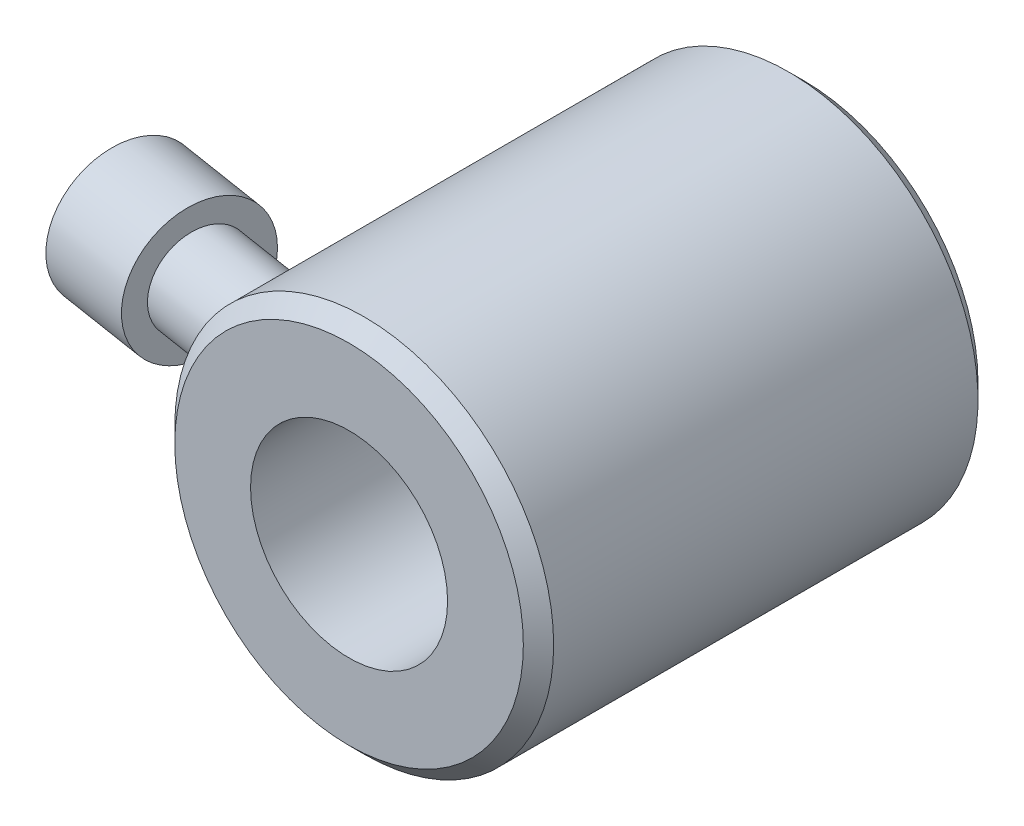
ISO-10303-21;
HEADER;
FILE_DESCRIPTION(('STEP AP214'),'2;1');
FILE_NAME('part.step','',(''),(''),'','','');
FILE_SCHEMA(('AUTOMOTIVE_DESIGN { 1 0 10303 214 1 1 1 1 }'));
ENDSEC;
DATA;
#1=APPLICATION_CONTEXT('core data for automotive mechanical design processes');
#2=APPLICATION_PROTOCOL_DEFINITION('international standard','automotive_design',2000,#1);
#3=PRODUCT_CONTEXT('',#1,'mechanical');
#4=PRODUCT('Part','Part','',(#3));
#5=PRODUCT_RELATED_PRODUCT_CATEGORY('part','',(#4));
#6=PRODUCT_DEFINITION_FORMATION('','',#4);
#7=PRODUCT_DEFINITION_CONTEXT('part definition',#1,'design');
#8=PRODUCT_DEFINITION('design','',#6,#7);
#9=PRODUCT_DEFINITION_SHAPE('','',#8);
#10=(LENGTH_UNIT() NAMED_UNIT(*) SI_UNIT(.MILLI.,.METRE.));
#11=(NAMED_UNIT(*) PLANE_ANGLE_UNIT() SI_UNIT($,.RADIAN.));
#12=(NAMED_UNIT(*) SI_UNIT($,.STERADIAN.) SOLID_ANGLE_UNIT());
#13=UNCERTAINTY_MEASURE_WITH_UNIT(LENGTH_MEASURE(1.E-05),#10,'distance_accuracy_value','');
#14=(GEOMETRIC_REPRESENTATION_CONTEXT(3) GLOBAL_UNCERTAINTY_ASSIGNED_CONTEXT((#13)) GLOBAL_UNIT_ASSIGNED_CONTEXT((#10,
#11,#12)) REPRESENTATION_CONTEXT('',''));
#15=CARTESIAN_POINT('',(0.,0.,0.));
#16=DIRECTION('',(0.,0.,1.));
#17=DIRECTION('',(1.,0.,0.));
#18=AXIS2_PLACEMENT_3D('',#15,#16,#17);
#19=CARTESIAN_POINT('',(0.,0.,64.));
#20=DIRECTION('',(0.,0.,1.));
#21=DIRECTION('',(-1.,0.,0.));
#22=AXIS2_PLACEMENT_3D('',#19,#20,#21);
#23=CYLINDRICAL_SURFACE('',#22,25.);
#24=CARTESIAN_POINT('',(-25.,0.,36.0335852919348));
#25=CARTESIAN_POINT('',(-25.0000025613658,-0.160958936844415,36.0335798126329));
#26=CARTESIAN_POINT('',(-24.9984430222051,-0.321867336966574,36.0403916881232));
#27=CARTESIAN_POINT('',(-24.9922555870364,-0.642524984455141,36.0675508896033));
#28=CARTESIAN_POINT('',(-24.9876272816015,-0.802274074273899,36.0879000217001));
#29=CARTESIAN_POINT('',(-24.9754291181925,-1.11944267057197,36.1419265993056));
#30=CARTESIAN_POINT('',(-24.9678580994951,-1.27686123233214,36.1756093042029));
#31=CARTESIAN_POINT('',(-24.9499856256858,-1.58825269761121,36.2559548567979));
#32=CARTESIAN_POINT('',(-24.9396831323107,-1.74222426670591,36.3026226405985));
#33=CARTESIAN_POINT('',(-24.9166642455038,-2.0452057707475,36.4083146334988));
#34=CARTESIAN_POINT('',(-24.9039544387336,-2.19422796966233,36.4673051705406));
#35=CARTESIAN_POINT('',(-24.8764380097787,-2.48685392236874,36.597178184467));
#36=CARTESIAN_POINT('',(-24.861630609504,-2.63045564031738,36.6680650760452));
#37=CARTESIAN_POINT('',(-24.8303109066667,-2.91129032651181,36.821070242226));
#38=CARTESIAN_POINT('',(-24.813799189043,-3.04852545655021,36.9031846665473));
#39=CARTESIAN_POINT('',(-24.7794825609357,-3.3159388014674,37.0779951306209));
#40=CARTESIAN_POINT('',(-24.7616771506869,-3.44611425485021,37.1706952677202));
#41=CARTESIAN_POINT('',(-24.7055632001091,-3.83474152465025,37.4711993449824));
#42=CARTESIAN_POINT('',(-24.6658104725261,-4.08048334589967,37.6955171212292));
#43=CARTESIAN_POINT('',(-24.5866599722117,-4.53311957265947,38.1804968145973));
#44=CARTESIAN_POINT('',(-24.5472623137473,-4.74000186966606,38.4411700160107));
#45=CARTESIAN_POINT('',(-24.4903550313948,-5.02319518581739,38.8622533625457));
#46=CARTESIAN_POINT('',(-24.4712665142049,-5.11515102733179,39.0121514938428));
#47=CARTESIAN_POINT('',(-24.4348553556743,-5.28635096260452,39.3192202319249));
#48=CARTESIAN_POINT('',(-24.4175321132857,-5.36559938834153,39.4763883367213));
#49=CARTESIAN_POINT('',(-24.3851580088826,-5.51086312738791,39.7970341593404));
#50=CARTESIAN_POINT('',(-24.3701082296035,-5.57687214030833,39.9605148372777));
#51=CARTESIAN_POINT('',(-24.342758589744,-5.69506674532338,40.2925543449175));
#52=CARTESIAN_POINT('',(-24.3304576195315,-5.74725791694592,40.46111109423));
#53=CARTESIAN_POINT('',(-24.3089408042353,-5.83759948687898,40.8030647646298));
#54=CARTESIAN_POINT('',(-24.2997409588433,-5.87567716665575,40.9764819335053));
#55=CARTESIAN_POINT('',(-24.2848352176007,-5.93698374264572,41.3260055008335));
#56=CARTESIAN_POINT('',(-24.2791279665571,-5.96021839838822,41.5021108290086));
#57=CARTESIAN_POINT('',(-24.2714206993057,-5.99152725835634,41.8557408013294));
#58=CARTESIAN_POINT('',(-24.2694205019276,-5.99960220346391,42.0332653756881));
#59=CARTESIAN_POINT('',(-24.2692310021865,-6.00036905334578,42.3883494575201));
#60=CARTESIAN_POINT('',(-24.2710415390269,-5.99306160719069,42.5659089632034));
#61=CARTESIAN_POINT('',(-24.278296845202,-5.96359943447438,42.912281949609));
#62=CARTESIAN_POINT('',(-24.2835875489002,-5.9420739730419,43.0811523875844));
#63=CARTESIAN_POINT('',(-24.2975168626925,-5.88485691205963,43.4163344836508));
#64=CARTESIAN_POINT('',(-24.3061553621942,-5.84916578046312,43.5826462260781));
#65=CARTESIAN_POINT('',(-24.3265392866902,-5.76380159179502,43.9114248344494));
#66=CARTESIAN_POINT('',(-24.338284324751,-5.7141302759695,44.0738921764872));
#67=CARTESIAN_POINT('',(-24.3645412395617,-5.60111528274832,44.3937683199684));
#68=CARTESIAN_POINT('',(-24.379053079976,-5.53777178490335,44.5511771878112));
#69=CARTESIAN_POINT('',(-24.4099464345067,-5.39993964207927,44.8551523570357));
#70=CARTESIAN_POINT('',(-24.4262593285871,-5.32583946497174,45.0019019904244));
#71=CARTESIAN_POINT('',(-24.4606344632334,-5.16566259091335,45.2885634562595));
#72=CARTESIAN_POINT('',(-24.4786972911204,-5.07958186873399,45.4284729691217));
#73=CARTESIAN_POINT('',(-24.5160565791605,-4.89609321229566,45.7004096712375));
#74=CARTESIAN_POINT('',(-24.535352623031,-4.79868909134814,45.8324394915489));
#75=CARTESIAN_POINT('',(-24.5746561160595,-4.59317130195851,46.0878496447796));
#76=CARTESIAN_POINT('',(-24.594663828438,-4.48505364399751,46.2112267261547));
#77=CARTESIAN_POINT('',(-24.6349461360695,-4.25825826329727,46.4491502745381));
#78=CARTESIAN_POINT('',(-24.6552215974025,-4.13952501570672,46.563643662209));
#79=CARTESIAN_POINT('',(-24.6953788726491,-3.8927992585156,46.7823477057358));
#80=CARTESIAN_POINT('',(-24.7152605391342,-3.76480336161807,46.8865545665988));
#81=CARTESIAN_POINT('',(-24.7540750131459,-3.50051425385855,47.0839595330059));
#82=CARTESIAN_POINT('',(-24.7730081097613,-3.36422359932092,47.1771610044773));
#83=CARTESIAN_POINT('',(-24.8094276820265,-3.08419178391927,47.352050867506));
#84=CARTESIAN_POINT('',(-24.8269136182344,-2.9404478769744,47.4337349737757));
#85=CARTESIAN_POINT('',(-24.860188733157,-2.64451979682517,47.586086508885));
#86=CARTESIAN_POINT('',(-24.875951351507,-2.49224690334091,47.6565874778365));
#87=CARTESIAN_POINT('',(-24.9050727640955,-2.18211273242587,47.7847791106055));
#88=CARTESIAN_POINT('',(-24.9184306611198,-2.02424939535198,47.8424649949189));
#89=CARTESIAN_POINT('',(-24.9423653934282,-1.70415734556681,47.9446073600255));
#90=CARTESIAN_POINT('',(-24.9529432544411,-1.5419302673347,47.9890687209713));
#91=CARTESIAN_POINT('',(-24.9710394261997,-1.21414544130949,48.0645205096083));
#92=CARTESIAN_POINT('',(-24.978556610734,-1.04858649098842,48.0955059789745));
#93=CARTESIAN_POINT('',(-24.9903229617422,-0.715237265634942,48.1437960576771));
#94=CARTESIAN_POINT('',(-24.9945697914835,-0.547445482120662,48.161090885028));
#95=CARTESIAN_POINT('',(-24.9996783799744,-0.210940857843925,48.1818661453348));
#96=CARTESIAN_POINT('',(-25.0005388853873,-0.0422276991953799,48.1853414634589));
#97=CARTESIAN_POINT('',(-24.9979651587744,0.463350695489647,48.1749311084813));
#98=CARTESIAN_POINT('',(-24.9893887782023,0.800022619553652,48.1402620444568));
#99=CARTESIAN_POINT('',(-24.9594432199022,1.46143291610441,48.0164783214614));
#100=CARTESIAN_POINT('',(-24.9381101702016,1.78620225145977,47.927517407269));
#101=CARTESIAN_POINT('',(-24.884998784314,2.41591794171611,47.697566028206));
#102=CARTESIAN_POINT('',(-24.8532200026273,2.72086345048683,47.5565733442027));
#103=CARTESIAN_POINT('',(-24.7825540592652,3.30324934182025,47.2255798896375));
#104=CARTESIAN_POINT('',(-24.7436449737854,3.58060070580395,47.035427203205));
#105=CARTESIAN_POINT('',(-24.6630880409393,4.09890011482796,46.6111436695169));
#106=CARTESIAN_POINT('',(-24.6214402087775,4.33984836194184,46.3770130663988));
#107=CARTESIAN_POINT('',(-24.5401763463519,4.77801637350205,45.871346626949));
#108=CARTESIAN_POINT('',(-24.5005566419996,4.97531753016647,45.5998819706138));
#109=CARTESIAN_POINT('',(-24.4278134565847,5.32102159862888,45.0266547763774));
#110=CARTESIAN_POINT('',(-24.3946890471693,5.46943150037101,44.7248965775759));
#111=CARTESIAN_POINT('',(-24.3391720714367,5.71139051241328,44.1043759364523));
#112=CARTESIAN_POINT('',(-24.3166287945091,5.80571457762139,43.785928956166));
#113=CARTESIAN_POINT('',(-24.2840210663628,5.94063945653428,43.1372646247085));
#114=CARTESIAN_POINT('',(-24.2739560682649,5.98124262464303,42.8070477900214));
#115=CARTESIAN_POINT('',(-24.2672495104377,6.00839294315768,42.1456086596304));
#116=CARTESIAN_POINT('',(-24.2705559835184,5.99514936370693,41.8143952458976));
#117=CARTESIAN_POINT('',(-24.2898501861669,5.916481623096,41.1586139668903));
#118=CARTESIAN_POINT('',(-24.3058400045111,5.8510488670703,40.8340472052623));
#119=CARTESIAN_POINT('',(-24.3492218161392,5.66784713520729,40.1899937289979));
#120=CARTESIAN_POINT('',(-24.3769511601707,5.54852209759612,39.8709745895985));
#121=CARTESIAN_POINT('',(-24.4406664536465,5.2607429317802,39.2565809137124));
#122=CARTESIAN_POINT('',(-24.4766546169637,5.09227562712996,38.9612127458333));
#123=CARTESIAN_POINT('',(-24.5346569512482,4.80217106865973,38.535947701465));
#124=CARTESIAN_POINT('',(-24.5551133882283,4.6967226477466,38.3945259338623));
#125=CARTESIAN_POINT('',(-24.5966078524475,4.47433503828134,38.1211401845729));
#126=CARTESIAN_POINT('',(-24.6176456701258,4.35739995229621,37.9891728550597));
#127=CARTESIAN_POINT('',(-24.6597146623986,4.11265073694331,37.7355897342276));
#128=CARTESIAN_POINT('',(-24.6807458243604,3.98482976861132,37.6139805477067));
#129=CARTESIAN_POINT('',(-24.7221705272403,3.71918580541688,37.382213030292));
#130=CARTESIAN_POINT('',(-24.7425643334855,3.58136705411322,37.2720498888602));
#131=CARTESIAN_POINT('',(-24.7820720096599,3.29688819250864,37.0643344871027));
#132=CARTESIAN_POINT('',(-24.8011889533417,3.15025105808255,36.9667513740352));
#133=CARTESIAN_POINT('',(-24.8376149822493,2.84884419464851,36.7848335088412));
#134=CARTESIAN_POINT('',(-24.8549248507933,2.69407803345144,36.7004930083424));
#135=CARTESIAN_POINT('',(-24.8871955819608,2.37755433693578,36.5459435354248));
#136=CARTESIAN_POINT('',(-24.902158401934,2.21580277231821,36.4757227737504));
#137=CARTESIAN_POINT('',(-24.9292710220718,1.88646995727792,36.3501307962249));
#138=CARTESIAN_POINT('',(-24.9414214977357,1.71889011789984,36.2947560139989));
#139=CARTESIAN_POINT('',(-24.9675679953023,1.29761833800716,36.1766496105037));
#140=CARTESIAN_POINT('',(-24.979655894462,1.04116124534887,36.1231194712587));
#141=CARTESIAN_POINT('',(-24.9958692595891,0.523091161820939,36.051594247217));
#142=CARTESIAN_POINT('',(-24.9999958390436,0.261478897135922,36.0335941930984));
#143=CARTESIAN_POINT('',(-25.,0.,36.0335852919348));
#144=B_SPLINE_CURVE_WITH_KNOTS('',3,(#24,#25,#26,#27,#28,#29,#30,#31,#32,#33,#34,#35,#36,#37,
#38,#39,#40,#41,#42,#43,#44,#45,#46,#47,#48,#49,#50,#51,#52,#53,#54,#55,#56,#57,#58,#59,#60,#61,
#62,#63,#64,#65,#66,#67,#68,#69,#70,#71,#72,#73,#74,#75,#76,#77,#78,#79,#80,#81,#82,#83,#84,#85,
#86,#87,#88,#89,#90,#91,#92,#93,#94,#95,#96,#97,#98,#99,#100,#101,#102,#103,#104,#105,#106,#107,
#108,#109,#110,#111,#112,#113,#114,#115,#116,#117,#118,#119,#120,#121,#122,#123,#124,#125,#126,
#127,#128,#129,#130,#131,#132,#133,#134,#135,#136,#137,#138,#139,#140,#141,#142,#143),
.UNSPECIFIED.,.T.,.F.,(4,2,2,2,2,2,2,2,2,2,2,2,2,2,2,2,2,2,2,2,2,2,2,2,2,2,2,2,2,2,2,2,2,2,2,2,
2,2,2,2,2,2,2,2,2,2,2,2,2,2,2,2,2,2,2,2,2,2,2,4),(0.,0.482638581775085,0.965341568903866,
1.44823514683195,1.93131254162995,2.41308679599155,2.89504023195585,3.3768288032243,
3.85880449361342,4.85945376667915,5.86041432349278,6.3905576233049,6.92051981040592,
7.45073360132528,7.98073296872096,8.51342635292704,9.04591291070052,9.57837344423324,
10.1108115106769,10.6211355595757,11.1314427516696,11.6416864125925,12.15192337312,
12.6469521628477,13.1421476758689,13.6371769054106,14.1323911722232,14.6303669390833,
15.1285257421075,15.6265317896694,16.1247226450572,16.6297462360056,17.1349578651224,
17.6399828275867,18.1451934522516,18.6507647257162,19.1565231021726,20.1669386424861,
21.1745060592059,22.1821164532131,23.1928786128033,24.2036351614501,25.2124906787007,
26.2212018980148,27.2150736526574,28.2089018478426,29.1988713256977,30.1890038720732,
31.2097591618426,32.2307883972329,32.7630377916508,33.2950977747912,33.8274945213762,
34.359666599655,34.8905076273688,35.4211175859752,35.9512826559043,36.4813202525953,
37.26547962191,38.0495293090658),.UNSPECIFIED.);
#145=CARTESIAN_POINT('',(-25.,0.,36.0335852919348));
#146=VERTEX_POINT('',#145);
#147=EDGE_CURVE('E9',#146,#146,#144,.T.);
#148=ORIENTED_EDGE('',*,*,#147,.F.);
#149=EDGE_LOOP('',(#148));
#150=FACE_BOUND('',#149,.T.);
#151=CARTESIAN_POINT('',(0.,0.,58.));
#152=DIRECTION('',(0.,0.,-1.));
#153=DIRECTION('',(1.,0.,0.));
#154=AXIS2_PLACEMENT_3D('',#151,#152,#153);
#155=CIRCLE('',#154,25.);
#156=CARTESIAN_POINT('',(25.,0.,58.));
#157=VERTEX_POINT('',#156);
#158=EDGE_CURVE('E199',#157,#157,#155,.T.);
#159=ORIENTED_EDGE('',*,*,#158,.T.);
#160=EDGE_LOOP('',(#159));
#161=FACE_BOUND('',#160,.T.);
#162=CARTESIAN_POINT('',(0.,0.,2.00000000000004));
#163=DIRECTION('',(0.,0.,1.));
#164=DIRECTION('',(-1.,0.,0.));
#165=AXIS2_PLACEMENT_3D('',#162,#163,#164);
#166=CIRCLE('',#165,25.);
#167=CARTESIAN_POINT('',(-25.,0.,2.00000000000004));
#168=VERTEX_POINT('',#167);
#169=EDGE_CURVE('E203',#168,#168,#166,.T.);
#170=ORIENTED_EDGE('',*,*,#169,.T.);
#171=EDGE_LOOP('',(#170));
#172=FACE_BOUND('',#171,.T.);
#173=CARTESIAN_POINT('',(-1.25,-24.9687304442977,17.));
#174=CARTESIAN_POINT('',(-1.24999690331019,-24.9687308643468,17.0701659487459));
#175=CARTESIAN_POINT('',(-1.24407224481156,-24.96902938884,17.1403816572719));
#176=CARTESIAN_POINT('',(-1.2205216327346,-24.9701914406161,17.2788760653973));
#177=CARTESIAN_POINT('',(-1.20288189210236,-24.9710556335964,17.3471523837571));
#178=CARTESIAN_POINT('',(-1.15640743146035,-24.9732508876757,17.4797417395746));
#179=CARTESIAN_POINT('',(-1.12757841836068,-24.9745817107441,17.5440567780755));
#180=CARTESIAN_POINT('',(-1.05955252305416,-24.9775599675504,17.6669173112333));
#181=CARTESIAN_POINT('',(-1.02035808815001,-24.9792073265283,17.7254641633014));
#182=CARTESIAN_POINT('',(-0.932669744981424,-24.9826349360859,17.8352030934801));
#183=CARTESIAN_POINT('',(-0.884167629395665,-24.9844153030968,17.8863886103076));
#184=CARTESIAN_POINT('',(-0.779257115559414,-24.9879072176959,17.9798959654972));
#185=CARTESIAN_POINT('',(-0.722848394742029,-24.9896187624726,18.0222174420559));
#186=CARTESIAN_POINT('',(-0.603691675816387,-24.9927810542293,18.0968133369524));
#187=CARTESIAN_POINT('',(-0.540940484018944,-24.9942316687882,18.1290826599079));
#188=CARTESIAN_POINT('',(-0.410902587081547,-24.9967074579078,18.1826255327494));
#189=CARTESIAN_POINT('',(-0.343615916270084,-24.9977326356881,18.2038991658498));
#190=CARTESIAN_POINT('',(-0.206477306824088,-24.9992412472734,18.2348294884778));
#191=CARTESIAN_POINT('',(-0.136627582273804,-24.9997251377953,18.2444959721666));
#192=CARTESIAN_POINT('',(0.00370464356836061,-25.0000981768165,18.2519678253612));
#193=CARTESIAN_POINT('',(0.0741871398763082,-24.9999873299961,18.2497732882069));
#194=CARTESIAN_POINT('',(0.213717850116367,-24.9991837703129,18.2335935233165));
#195=CARTESIAN_POINT('',(0.282767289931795,-24.9984915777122,18.2196188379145));
#196=CARTESIAN_POINT('',(0.417538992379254,-24.9966038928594,18.180291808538));
#197=CARTESIAN_POINT('',(0.483261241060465,-24.9954083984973,18.1549394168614));
#198=CARTESIAN_POINT('',(0.609546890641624,-24.9926478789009,18.09356461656));
#199=CARTESIAN_POINT('',(0.670107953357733,-24.9910826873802,18.0575374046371));
#200=CARTESIAN_POINT('',(0.784326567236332,-24.9877590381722,17.9758391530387));
#201=CARTESIAN_POINT('',(0.837984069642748,-24.9860005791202,17.9301680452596));
#202=CARTESIAN_POINT('',(0.936933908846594,-24.9824861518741,17.8304188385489));
#203=CARTESIAN_POINT('',(0.982217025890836,-24.9807301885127,17.7763315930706));
#204=CARTESIAN_POINT('',(1.06306164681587,-24.9774206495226,17.6613175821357));
#205=CARTESIAN_POINT('',(1.09862314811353,-24.9758670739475,17.6003908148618));
#206=CARTESIAN_POINT('',(1.15901427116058,-24.9731376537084,17.4734216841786));
#207=CARTESIAN_POINT('',(1.18384354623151,-24.9719618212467,17.4073791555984));
#208=CARTESIAN_POINT('',(1.2220592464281,-24.9701209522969,17.2720557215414));
#209=CARTESIAN_POINT('',(1.2354457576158,-24.9694559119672,17.2027748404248));
#210=CARTESIAN_POINT('',(1.25038453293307,-24.9687123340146,17.0630216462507));
#211=CARTESIAN_POINT('',(1.25194959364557,-24.9686331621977,16.992550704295));
#212=CARTESIAN_POINT('',(1.24323443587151,-24.9690685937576,16.8523472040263));
#213=CARTESIAN_POINT('',(1.23295425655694,-24.9695831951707,16.7826146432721));
#214=CARTESIAN_POINT('',(1.20085104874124,-24.9711475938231,16.6459033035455));
#215=CARTESIAN_POINT('',(1.17903387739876,-24.9721971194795,16.5789231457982));
#216=CARTESIAN_POINT('',(1.1244819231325,-24.9747128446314,16.4495754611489));
#217=CARTESIAN_POINT('',(1.09174707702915,-24.9761790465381,16.3872079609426));
#218=CARTESIAN_POINT('',(1.0162561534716,-24.9793644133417,16.2687971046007));
#219=CARTESIAN_POINT('',(0.973491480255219,-24.9810837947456,16.2127592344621));
#220=CARTESIAN_POINT('',(0.87916739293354,-24.9845809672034,16.1086535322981));
#221=CARTESIAN_POINT('',(0.827607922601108,-24.9863587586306,16.0605857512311));
#222=CARTESIAN_POINT('',(0.717102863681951,-24.9897742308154,15.973741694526));
#223=CARTESIAN_POINT('',(0.658150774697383,-24.9914117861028,15.9349736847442));
#224=CARTESIAN_POINT('',(0.534566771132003,-24.9943604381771,15.8678861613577));
#225=CARTESIAN_POINT('',(0.469934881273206,-24.995671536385,15.8395666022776));
#226=CARTESIAN_POINT('',(0.336856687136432,-24.9978189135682,15.7941943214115));
#227=CARTESIAN_POINT('',(0.268412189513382,-24.9986554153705,15.7771363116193));
#228=CARTESIAN_POINT('',(0.129626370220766,-24.999760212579,15.7547540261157));
#229=CARTESIAN_POINT('',(0.0592850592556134,-25.0000285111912,15.7494296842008));
#230=CARTESIAN_POINT('',(-0.081215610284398,-24.999966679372,15.7506665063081));
#231=CARTESIAN_POINT('',(-0.151375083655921,-24.9996372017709,15.7572147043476));
#232=CARTESIAN_POINT('',(-0.289597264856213,-24.9984181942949,15.7819839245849));
#233=CARTESIAN_POINT('',(-0.357659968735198,-24.9975286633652,15.80020496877));
#234=CARTESIAN_POINT('',(-0.489759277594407,-24.9952896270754,15.847800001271));
#235=CARTESIAN_POINT('',(-0.553795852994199,-24.9939401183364,15.8771740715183));
#236=CARTESIAN_POINT('',(-0.676029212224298,-24.9909328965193,15.946239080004));
#237=CARTESIAN_POINT('',(-0.734226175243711,-24.9892751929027,15.9859297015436));
#238=CARTESIAN_POINT('',(-0.843193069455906,-24.9858360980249,16.0745475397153));
#239=CARTESIAN_POINT('',(-0.893955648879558,-24.9840545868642,16.1234837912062));
#240=CARTESIAN_POINT('',(-0.98656087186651,-24.980569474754,16.2291978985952));
#241=CARTESIAN_POINT('',(-1.02840131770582,-24.9788658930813,16.2859776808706));
#242=CARTESIAN_POINT('',(-1.10199421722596,-24.9757276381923,16.405811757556));
#243=CARTESIAN_POINT('',(-1.13373694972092,-24.9742932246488,16.4688720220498));
#244=CARTESIAN_POINT('',(-1.18614637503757,-24.971859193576,16.5993869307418));
#245=CARTESIAN_POINT('',(-1.20682615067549,-24.970859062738,16.6668362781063));
#246=CARTESIAN_POINT('',(-1.23109826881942,-24.9696711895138,16.7789205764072));
#247=CARTESIAN_POINT('',(-1.23817736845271,-24.969319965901,16.8228295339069));
#248=CARTESIAN_POINT('',(-1.24762921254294,-24.9688494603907,16.9111523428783));
#249=CARTESIAN_POINT('',(-1.25000196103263,-24.9687301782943,16.9555661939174));
#250=CARTESIAN_POINT('',(-1.25,-24.9687304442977,17.));
#251=B_SPLINE_CURVE_WITH_KNOTS('',3,(#173,#174,#175,#176,#177,#178,#179,#180,#181,#182,#183,
#184,#185,#186,#187,#188,#189,#190,#191,#192,#193,#194,#195,#196,#197,#198,#199,#200,#201,#202,
#203,#204,#205,#206,#207,#208,#209,#210,#211,#212,#213,#214,#215,#216,#217,#218,#219,#220,#221,
#222,#223,#224,#225,#226,#227,#228,#229,#230,#231,#232,#233,#234,#235,#236,#237,#238,#239,#240,
#241,#242,#243,#244,#245,#246,#247,#248,#249,#250),.UNSPECIFIED.,.T.,.F.,(4,2,2,2,2,2,2,2,2,2,2,
2,2,2,2,2,2,2,2,2,2,2,2,2,2,2,2,2,2,2,2,2,2,2,2,2,2,2,4),(0.,0.210335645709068,
0.420919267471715,0.631395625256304,0.841822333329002,1.0524354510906,1.26305716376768,
1.47378546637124,1.68451217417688,1.89506094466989,2.10560805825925,2.31596694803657,
2.52632671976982,2.73678129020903,2.94723734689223,3.1579237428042,3.36861019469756,
3.57930345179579,3.78999512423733,4.00045869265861,4.2109215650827,4.42127769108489,
4.63163503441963,4.84217332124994,5.05271295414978,5.26343903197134,5.47416419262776,
5.68479033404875,5.89541528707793,6.10581035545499,6.31620582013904,6.52660283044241,
6.73699338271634,6.94759060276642,7.15823963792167,7.36909085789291,7.57969217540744,
7.71289099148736,7.84608969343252),.UNSPECIFIED.);
#252=CARTESIAN_POINT('',(-1.25,-24.9687304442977,17.));
#253=VERTEX_POINT('',#252);
#254=EDGE_CURVE('E137',#253,#253,#251,.T.);
#255=ORIENTED_EDGE('',*,*,#254,.T.);
#256=EDGE_LOOP('',(#255));
#257=FACE_BOUND('',#256,.T.);
#258=ADVANCED_FACE('F14',(#150,#161,#172,#257),#23,.T.);
#259=CARTESIAN_POINT('',(0.,0.,64.));
#260=DIRECTION('',(0.,0.,1.));
#261=DIRECTION('',(-1.,0.,0.));
#262=AXIS2_PLACEMENT_3D('',#259,#260,#261);
#263=CYLINDRICAL_SURFACE('',#262,13.);
#264=CARTESIAN_POINT('',(0.,0.,60.));
#265=DIRECTION('',(0.,0.,1.));
#266=DIRECTION('',(-1.,0.,0.));
#267=AXIS2_PLACEMENT_3D('',#264,#265,#266);
#268=CIRCLE('',#267,13.);
#269=CARTESIAN_POINT('',(-13.,0.,60.));
#270=VERTEX_POINT('',#269);
#271=EDGE_CURVE('E144',#270,#270,#268,.T.);
#272=ORIENTED_EDGE('',*,*,#271,.T.);
#273=EDGE_LOOP('',(#272));
#274=FACE_BOUND('',#273,.T.);
#275=CARTESIAN_POINT('',(0.,0.,8.));
#276=DIRECTION('',(0.,0.,1.));
#277=DIRECTION('',(-1.,0.,0.));
#278=AXIS2_PLACEMENT_3D('',#275,#276,#277);
#279=CIRCLE('',#278,13.);
#280=CARTESIAN_POINT('',(-13.,0.,8.));
#281=VERTEX_POINT('',#280);
#282=EDGE_CURVE('E372',#281,#281,#279,.T.);
#283=ORIENTED_EDGE('',*,*,#282,.F.);
#284=EDGE_LOOP('',(#283));
#285=FACE_BOUND('',#284,.T.);
#286=CARTESIAN_POINT('',(-1.25,-12.9397642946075,17.));
#287=CARTESIAN_POINT('',(-1.24999695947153,-12.9397650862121,17.0700387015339));
#288=CARTESIAN_POINT('',(-1.2440936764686,-12.9403390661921,17.1401240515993));
#289=CARTESIAN_POINT('',(-1.22063294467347,-12.942572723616,17.2783525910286));
#290=CARTESIAN_POINT('',(-1.20306256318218,-12.9442336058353,17.3464935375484));
#291=CARTESIAN_POINT('',(-1.15678313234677,-12.9484512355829,17.478811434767));
#292=CARTESIAN_POINT('',(-1.12808072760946,-12.9510074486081,17.5429907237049));
#293=CARTESIAN_POINT('',(-1.06036454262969,-12.9567270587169,17.665606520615));
#294=CARTESIAN_POINT('',(-1.02135284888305,-12.9598903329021,17.724044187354));
#295=CARTESIAN_POINT('',(-0.933983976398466,-12.9664795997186,17.8337292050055));
#296=CARTESIAN_POINT('',(-0.885599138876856,-12.9699063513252,17.8849544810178));
#297=CARTESIAN_POINT('',(-0.780916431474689,-12.9766295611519,17.9785706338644));
#298=CARTESIAN_POINT('',(-0.724618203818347,-12.9799260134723,18.0209611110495));
#299=CARTESIAN_POINT('',(-0.605572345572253,-12.9860246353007,18.0957800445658));
#300=CARTESIAN_POINT('',(-0.54281244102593,-12.9888258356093,18.1281890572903));
#301=CARTESIAN_POINT('',(-0.412710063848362,-12.9936100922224,18.1820007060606));
#302=CARTESIAN_POINT('',(-0.345367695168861,-12.9955931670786,18.2034035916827));
#303=CARTESIAN_POINT('',(-0.208234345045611,-12.9985124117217,18.2345309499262));
#304=CARTESIAN_POINT('',(-0.138451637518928,-12.9994518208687,18.2442915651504));
#305=CARTESIAN_POINT('',(0.00176737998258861,-13.0001888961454,18.2519691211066));
#306=CARTESIAN_POINT('',(0.0722036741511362,-12.9999865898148,18.2498863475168));
#307=CARTESIAN_POINT('',(0.211485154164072,-12.9984656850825,18.2339656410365));
#308=CARTESIAN_POINT('',(0.2803348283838,-12.9971507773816,18.2201665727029));
#309=CARTESIAN_POINT('',(0.414736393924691,-12.9935567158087,18.1812654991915));
#310=CARTESIAN_POINT('',(0.48028824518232,-12.9912775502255,18.1561633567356));
#311=CARTESIAN_POINT('',(0.606356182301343,-12.9860049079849,18.0953259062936));
#312=CARTESIAN_POINT('',(0.666863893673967,-12.9830102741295,18.0595733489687));
#313=CARTESIAN_POINT('',(0.781034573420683,-12.9766428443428,17.9784624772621));
#314=CARTESIAN_POINT('',(0.834697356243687,-12.9732700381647,17.9331039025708));
#315=CARTESIAN_POINT('',(0.933882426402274,-12.966508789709,17.8338498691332));
#316=CARTESIAN_POINT('',(0.97937089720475,-12.9631203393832,17.7799206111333));
#317=CARTESIAN_POINT('',(1.06065442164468,-12.956723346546,17.6651733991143));
#318=CARTESIAN_POINT('',(1.09644946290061,-12.9537148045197,17.6043554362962));
#319=CARTESIAN_POINT('',(1.15732959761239,-12.9484179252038,17.4775317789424));
#320=CARTESIAN_POINT('',(1.18241268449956,-12.9461297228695,17.411525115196));
#321=CARTESIAN_POINT('',(1.22113055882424,-12.9425353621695,17.2762102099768));
#322=CARTESIAN_POINT('',(1.23476566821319,-12.9412291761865,17.2069020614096));
#323=CARTESIAN_POINT('',(1.25015720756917,-12.9397514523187,17.0672482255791));
#324=CARTESIAN_POINT('',(1.25196090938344,-12.9395753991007,16.9969077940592));
#325=CARTESIAN_POINT('',(1.24376250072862,-12.9403659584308,16.8569256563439));
#326=CARTESIAN_POINT('',(1.23376053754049,-12.9413325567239,16.7872839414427));
#327=CARTESIAN_POINT('',(1.20227423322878,-12.9442953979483,16.650813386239));
#328=CARTESIAN_POINT('',(1.18081217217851,-12.9462896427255,16.5839793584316));
#329=CARTESIAN_POINT('',(1.12703762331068,-12.9510814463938,16.4548602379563));
#330=CARTESIAN_POINT('',(1.09472490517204,-12.9538790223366,16.3925752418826));
#331=CARTESIAN_POINT('',(1.0200475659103,-12.9599732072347,16.2741065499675));
#332=CARTESIAN_POINT('',(0.977651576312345,-12.9632713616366,16.2179427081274));
#333=CARTESIAN_POINT('',(0.884056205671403,-12.9699899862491,16.1135117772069));
#334=CARTESIAN_POINT('',(0.832856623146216,-12.9734104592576,16.0652448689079));
#335=CARTESIAN_POINT('',(0.722902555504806,-12.9800019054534,15.9778153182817));
#336=CARTESIAN_POINT('',(0.664123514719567,-12.9831720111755,15.93868348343));
#337=CARTESIAN_POINT('',(0.540800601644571,-12.9888929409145,15.8708467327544));
#338=CARTESIAN_POINT('',(0.476256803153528,-12.9914437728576,15.8421416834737));
#339=CARTESIAN_POINT('',(0.343344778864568,-12.9956348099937,15.7960257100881));
#340=CARTESIAN_POINT('',(0.274983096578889,-12.9972765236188,15.7785960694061));
#341=CARTESIAN_POINT('',(0.136286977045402,-12.9994705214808,15.7554645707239));
#342=CARTESIAN_POINT('',(0.0659525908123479,-13.0000228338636,15.7497624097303));
#343=CARTESIAN_POINT('',(-0.0743895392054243,-12.999975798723,15.7502518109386));
#344=CARTESIAN_POINT('',(-0.144397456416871,-12.9993810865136,15.7563955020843));
#345=CARTESIAN_POINT('',(-0.282381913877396,-12.9971159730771,15.7803019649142));
#346=CARTESIAN_POINT('',(-0.350358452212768,-12.9954455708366,15.7980647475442));
#347=CARTESIAN_POINT('',(-0.482351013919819,-12.9912162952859,15.8446921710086));
#348=CARTESIAN_POINT('',(-0.546367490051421,-12.9886575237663,15.8735555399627));
#349=CARTESIAN_POINT('',(-0.668654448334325,-12.9829369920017,15.94155963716));
#350=CARTESIAN_POINT('',(-0.726924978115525,-12.9797752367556,15.9807002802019));
#351=CARTESIAN_POINT('',(-0.836311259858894,-12.9731878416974,16.0683275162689));
#352=CARTESIAN_POINT('',(-0.887398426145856,-12.9697612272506,16.1168497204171));
#353=CARTESIAN_POINT('',(-0.980727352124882,-12.9630385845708,16.2217935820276));
#354=CARTESIAN_POINT('',(-1.02296698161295,-12.9597425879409,16.2782171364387));
#355=CARTESIAN_POINT('',(-1.09747961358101,-12.9536459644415,16.3975071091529));
#356=CARTESIAN_POINT('',(-1.12972870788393,-12.9508465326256,16.4603885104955));
#357=CARTESIAN_POINT('',(-1.18316795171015,-12.946074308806,16.5906599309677));
#358=CARTESIAN_POINT('',(-1.20437063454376,-12.9441005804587,16.6580447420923));
#359=CARTESIAN_POINT('',(-1.22979995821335,-12.941703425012,16.7715126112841));
#360=CARTESIAN_POINT('',(-1.23736469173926,-12.9409796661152,16.8168691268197));
#361=CARTESIAN_POINT('',(-1.24746570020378,-12.9400098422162,16.9081437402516));
#362=CARTESIAN_POINT('',(-1.25000199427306,-12.9397637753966,16.9540618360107));
#363=CARTESIAN_POINT('',(-1.25,-12.9397642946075,17.));
#364=B_SPLINE_CURVE_WITH_KNOTS('',3,(#286,#287,#288,#289,#290,#291,#292,#293,#294,#295,#296,
#297,#298,#299,#300,#301,#302,#303,#304,#305,#306,#307,#308,#309,#310,#311,#312,#313,#314,#315,
#316,#317,#318,#319,#320,#321,#322,#323,#324,#325,#326,#327,#328,#329,#330,#331,#332,#333,#334,
#335,#336,#337,#338,#339,#340,#341,#342,#343,#344,#345,#346,#347,#348,#349,#350,#351,#352,#353,
#354,#355,#356,#357,#358,#359,#360,#361,#362,#363),.UNSPECIFIED.,.T.,.F.,(4,2,2,2,2,2,2,2,2,2,2,
2,2,2,2,2,2,2,2,2,2,2,2,2,2,2,2,2,2,2,2,2,2,2,2,2,2,2,4),(0.,0.209948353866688,
0.420129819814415,0.630186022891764,0.840199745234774,1.05084289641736,1.26149557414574,
1.47255603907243,1.68361171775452,1.89401046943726,2.10440414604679,2.31410263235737,
2.52380366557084,2.73384619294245,2.94389441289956,3.15479252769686,3.36569091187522,
3.5766287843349,3.78756072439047,3.99764937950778,4.20773541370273,4.41741448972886,
4.62709801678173,4.83744259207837,5.04779198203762,5.2588408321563,5.46988698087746,
5.68058189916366,5.8912713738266,6.10111120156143,6.31095122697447,6.52076721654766,
6.73058146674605,6.94120835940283,7.15188590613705,7.36306379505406,7.57400155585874,
7.71170654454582,7.84941100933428),.UNSPECIFIED.);
#365=CARTESIAN_POINT('',(-1.25,-12.9397642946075,17.));
#366=VERTEX_POINT('',#365);
#367=EDGE_CURVE('E136',#366,#366,#364,.T.);
#368=ORIENTED_EDGE('',*,*,#367,.F.);
#369=EDGE_LOOP('',(#368));
#370=FACE_BOUND('',#369,.T.);
#371=ADVANCED_FACE('F168',(#274,#285,#370),#263,.F.);
#372=CARTESIAN_POINT('',(0.,-6.5,0.));
#373=DIRECTION('',(0.,0.,1.));
#374=DIRECTION('',(-1.,0.,0.));
#375=AXIS2_PLACEMENT_3D('',#372,#373,#374);
#376=PLANE('',#375);
#377=CARTESIAN_POINT('',(0.,0.,0.));
#378=DIRECTION('',(0.,0.,1.));
#379=DIRECTION('',(-1.,0.,0.));
#380=AXIS2_PLACEMENT_3D('',#377,#378,#379);
#381=CIRCLE('',#380,23.);
#382=CARTESIAN_POINT('',(-23.,0.,0.));
#383=VERTEX_POINT('',#382);
#384=EDGE_CURVE('E26',#383,#383,#381,.F.);
#385=ORIENTED_EDGE('',*,*,#384,.T.);
#386=EDGE_LOOP('',(#385));
#387=FACE_BOUND('',#386,.T.);
#388=CARTESIAN_POINT('',(0.,0.,0.));
#389=DIRECTION('',(0.,0.,1.));
#390=DIRECTION('',(-1.,0.,0.));
#391=AXIS2_PLACEMENT_3D('',#388,#389,#390);
#392=CIRCLE('',#391,6.5);
#393=CARTESIAN_POINT('',(-6.5,0.,0.));
#394=VERTEX_POINT('',#393);
#395=EDGE_CURVE('E164',#394,#394,#392,.T.);
#396=ORIENTED_EDGE('',*,*,#395,.T.);
#397=EDGE_LOOP('',(#396));
#398=FACE_BOUND('',#397,.T.);
#399=ADVANCED_FACE('F172',(#387,#398),#376,.F.);
#400=CARTESIAN_POINT('',(0.,0.,64.));
#401=DIRECTION('',(0.,0.,1.));
#402=DIRECTION('',(-1.,0.,0.));
#403=AXIS2_PLACEMENT_3D('',#400,#401,#402);
#404=CYLINDRICAL_SURFACE('',#403,6.5);
#405=ORIENTED_EDGE('',*,*,#395,.F.);
#406=EDGE_LOOP('',(#405));
#407=FACE_BOUND('',#406,.T.);
#408=CARTESIAN_POINT('',(0.,0.,8.));
#409=DIRECTION('',(0.,0.,1.));
#410=DIRECTION('',(-1.,0.,0.));
#411=AXIS2_PLACEMENT_3D('',#408,#409,#410);
#412=CIRCLE('',#411,6.5);
#413=CARTESIAN_POINT('',(-6.5,0.,8.));
#414=VERTEX_POINT('',#413);
#415=EDGE_CURVE('E374',#414,#414,#412,.T.);
#416=ORIENTED_EDGE('',*,*,#415,.T.);
#417=EDGE_LOOP('',(#416));
#418=FACE_BOUND('',#417,.T.);
#419=ADVANCED_FACE('F177',(#407,#418),#404,.F.);
#420=CARTESIAN_POINT('',(0.,-13.,8.));
#421=DIRECTION('',(0.,0.,-1.));
#422=DIRECTION('',(1.,0.,0.));
#423=AXIS2_PLACEMENT_3D('',#420,#421,#422);
#424=PLANE('',#423);
#425=ORIENTED_EDGE('',*,*,#415,.F.);
#426=EDGE_LOOP('',(#425));
#427=FACE_BOUND('',#426,.T.);
#428=ORIENTED_EDGE('',*,*,#282,.T.);
#429=EDGE_LOOP('',(#428));
#430=FACE_BOUND('',#429,.T.);
#431=ADVANCED_FACE('F174',(#427,#430),#424,.F.);
#432=CARTESIAN_POINT('',(0.,-25.,60.));
#433=DIRECTION('',(0.,0.,-1.));
#434=DIRECTION('',(1.,0.,0.));
#435=AXIS2_PLACEMENT_3D('',#432,#433,#434);
#436=PLANE('',#435);
#437=CARTESIAN_POINT('',(0.,0.,60.));
#438=DIRECTION('',(0.,0.,-1.));
#439=DIRECTION('',(1.,0.,0.));
#440=AXIS2_PLACEMENT_3D('',#437,#438,#439);
#441=CIRCLE('',#440,23.);
#442=CARTESIAN_POINT('',(23.,0.,60.));
#443=VERTEX_POINT('',#442);
#444=EDGE_CURVE('E166',#443,#443,#441,.F.);
#445=ORIENTED_EDGE('',*,*,#444,.T.);
#446=EDGE_LOOP('',(#445));
#447=FACE_BOUND('',#446,.T.);
#448=ORIENTED_EDGE('',*,*,#271,.F.);
#449=EDGE_LOOP('',(#448));
#450=FACE_BOUND('',#449,.T.);
#451=ADVANCED_FACE('F152',(#447,#450),#436,.F.);
#452=CARTESIAN_POINT('',(0.,17.,17.));
#453=DIRECTION('',(0.,1.,0.));
#454=DIRECTION('',(-1.,0.,0.));
#455=AXIS2_PLACEMENT_3D('',#452,#453,#454);
#456=CYLINDRICAL_SURFACE('',#455,1.25);
#457=ORIENTED_EDGE('',*,*,#254,.F.);
#458=EDGE_LOOP('',(#457));
#459=FACE_BOUND('',#458,.T.);
#460=ORIENTED_EDGE('',*,*,#367,.T.);
#461=EDGE_LOOP('',(#460));
#462=FACE_BOUND('',#461,.T.);
#463=ADVANCED_FACE('F146',(#459,#462),#456,.F.);
#464=CARTESIAN_POINT('',(0.,0.,60.));
#465=DIRECTION('',(0.,0.,-1.));
#466=DIRECTION('',(1.,0.,0.));
#467=AXIS2_PLACEMENT_3D('',#464,#465,#466);
#468=CONICAL_SURFACE('',#467,23.,0.785398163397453);
#469=ORIENTED_EDGE('',*,*,#158,.F.);
#470=EDGE_LOOP('',(#469));
#471=FACE_BOUND('',#470,.T.);
#472=ORIENTED_EDGE('',*,*,#444,.F.);
#473=EDGE_LOOP('',(#472));
#474=FACE_BOUND('',#473,.T.);
#475=ADVANCED_FACE('F151',(#471,#474),#468,.T.);
#476=CARTESIAN_POINT('',(0.,0.,2.00000000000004));
#477=DIRECTION('',(0.,0.,1.));
#478=DIRECTION('',(-1.,0.,0.));
#479=AXIS2_PLACEMENT_3D('',#476,#477,#478);
#480=CONICAL_SURFACE('',#479,25.,0.785398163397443);
#481=ORIENTED_EDGE('',*,*,#384,.F.);
#482=EDGE_LOOP('',(#481));
#483=FACE_BOUND('',#482,.T.);
#484=ORIENTED_EDGE('',*,*,#169,.F.);
#485=EDGE_LOOP('',(#484));
#486=FACE_BOUND('',#485,.T.);
#487=ADVANCED_FACE('F213',(#483,#486),#480,.T.);
#488=CARTESIAN_POINT('',(-53.2715634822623,0.,46.7427864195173));
#489=DIRECTION('',(0.987688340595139,0.,0.156434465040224));
#490=DIRECTION('',(-0.156434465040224,0.,0.987688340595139));
#491=AXIS2_PLACEMENT_3D('',#488,#489,#490);
#492=PLANE('',#491);
#493=DIRECTION('',(-0.135476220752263,0.5,0.855363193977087));
#494=VECTOR('',#493,1.);
#495=CARTESIAN_POINT('',(-51.8636532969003,-5.77350269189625,37.8535913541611));
#496=LINE('',#495,#494);
#497=CARTESIAN_POINT('',(-51.8636532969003,-5.77350269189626,37.8535913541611));
#498=VERTEX_POINT('',#497);
#499=CARTESIAN_POINT('',(-52.6458256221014,-2.88675134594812,42.7920330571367));
#500=VERTEX_POINT('',#499);
#501=EDGE_CURVE('E87',#498,#500,#496,.T.);
#502=ORIENTED_EDGE('',*,*,#501,.F.);
#503=DIRECTION('',(-0.135476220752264,-0.5,0.855363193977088));
#504=VECTOR('',#503,1.);
#505=CARTESIAN_POINT('',(-51.0814809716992,-2.88675134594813,32.9151496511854));
#506=LINE('',#505,#504);
#507=CARTESIAN_POINT('',(-51.0814809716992,-2.88675134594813,32.9151496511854));
#508=VERTEX_POINT('',#507);
#509=EDGE_CURVE('E33',#508,#498,#506,.T.);
#510=ORIENTED_EDGE('',*,*,#509,.F.);
#511=DIRECTION('',(0.,-1.,0.));
#512=VECTOR('',#511,1.);
#513=CARTESIAN_POINT('',(-51.0814809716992,2.88675134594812,32.9151496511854));
#514=LINE('',#513,#512);
#515=CARTESIAN_POINT('',(-51.0814809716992,2.88675134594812,32.9151496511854));
#516=VERTEX_POINT('',#515);
#517=EDGE_CURVE('E103',#516,#508,#514,.T.);
#518=ORIENTED_EDGE('',*,*,#517,.F.);
#519=DIRECTION('',(0.135476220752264,-0.5,-0.855363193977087));
#520=VECTOR('',#519,1.);
#521=CARTESIAN_POINT('',(-51.8636532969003,5.77350269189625,37.8535913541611));
#522=LINE('',#521,#520);
#523=CARTESIAN_POINT('',(-51.8636532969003,5.77350269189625,37.8535913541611));
#524=VERTEX_POINT('',#523);
#525=EDGE_CURVE('E97',#524,#516,#522,.T.);
#526=ORIENTED_EDGE('',*,*,#525,.F.);
#527=DIRECTION('',(0.135476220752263,0.5,-0.855363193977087));
#528=VECTOR('',#527,1.);
#529=CARTESIAN_POINT('',(-52.6458256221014,2.88675134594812,42.7920330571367));
#530=LINE('',#529,#528);
#531=CARTESIAN_POINT('',(-52.6458256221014,2.88675134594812,42.7920330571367));
#532=VERTEX_POINT('',#531);
#533=EDGE_CURVE('E95',#532,#524,#530,.T.);
#534=ORIENTED_EDGE('',*,*,#533,.F.);
#535=DIRECTION('',(0.,1.,0.));
#536=VECTOR('',#535,1.);
#537=CARTESIAN_POINT('',(-52.6458256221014,-2.88675134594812,42.7920330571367));
#538=LINE('',#537,#536);
#539=EDGE_CURVE('E76',#500,#532,#538,.T.);
#540=ORIENTED_EDGE('',*,*,#539,.F.);
#541=EDGE_LOOP('',(#502,#510,#518,#526,#534,#540));
#542=FACE_BOUND('',#541,.T.);
#543=CARTESIAN_POINT('',(-51.8636532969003,0.,37.8535913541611));
#544=DIRECTION('',(-0.987688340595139,0.,-0.156434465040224));
#545=DIRECTION('',(0.156434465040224,0.,-0.987688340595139));
#546=AXIS2_PLACEMENT_3D('',#543,#544,#545);
#547=CIRCLE('',#546,9.);
#548=CARTESIAN_POINT('',(-50.4557431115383,0.,28.9643962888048));
#549=VERTEX_POINT('',#548);
#550=EDGE_CURVE('E133',#549,#549,#547,.T.);
#551=ORIENTED_EDGE('',*,*,#550,.T.);
#552=EDGE_LOOP('',(#551));
#553=FACE_BOUND('',#552,.T.);
#554=ADVANCED_FACE('F91',(#542,#553),#492,.F.);
#555=CARTESIAN_POINT('',(-33.373530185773,0.,40.7821391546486));
#556=DIRECTION('',(-0.987688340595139,0.,-0.156434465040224));
#557=DIRECTION('',(0.156434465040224,0.,-0.987688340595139));
#558=AXIS2_PLACEMENT_3D('',#555,#556,#557);
#559=CYLINDRICAL_SURFACE('',#558,9.);
#560=CARTESIAN_POINT('',(-40.0113932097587,0.,39.7308049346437));
#561=DIRECTION('',(-0.987688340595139,0.,-0.156434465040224));
#562=DIRECTION('',(0.156434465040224,0.,-0.987688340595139));
#563=AXIS2_PLACEMENT_3D('',#560,#561,#562);
#564=CIRCLE('',#563,9.);
#565=CARTESIAN_POINT('',(-38.6034830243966,0.,30.8416098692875));
#566=VERTEX_POINT('',#565);
#567=EDGE_CURVE('E130',#566,#566,#564,.T.);
#568=ORIENTED_EDGE('',*,*,#567,.T.);
#569=EDGE_LOOP('',(#568));
#570=FACE_BOUND('',#569,.T.);
#571=ORIENTED_EDGE('',*,*,#550,.F.);
#572=EDGE_LOOP('',(#571));
#573=FACE_BOUND('',#572,.T.);
#574=ADVANCED_FACE('F220',(#570,#573),#559,.T.);
#575=CARTESIAN_POINT('',(-41.4193033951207,0.,48.62));
#576=DIRECTION('',(0.987688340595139,0.,0.156434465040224));
#577=DIRECTION('',(-0.156434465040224,0.,0.987688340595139));
#578=AXIS2_PLACEMENT_3D('',#575,#576,#577);
#579=PLANE('',#578);
#580=CARTESIAN_POINT('',(-40.0113932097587,0.,39.7308049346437));
#581=DIRECTION('',(-0.987688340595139,0.,-0.156434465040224));
#582=DIRECTION('',(0.156434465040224,0.,-0.987688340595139));
#583=AXIS2_PLACEMENT_3D('',#580,#581,#582);
#584=CIRCLE('',#583,6.);
#585=CARTESIAN_POINT('',(-39.0727864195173,0.,33.8046748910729));
#586=VERTEX_POINT('',#585);
#587=EDGE_CURVE('E121',#586,#586,#584,.T.);
#588=ORIENTED_EDGE('',*,*,#587,.T.);
#589=EDGE_LOOP('',(#588));
#590=FACE_BOUND('',#589,.T.);
#591=ORIENTED_EDGE('',*,*,#567,.F.);
#592=EDGE_LOOP('',(#591));
#593=FACE_BOUND('',#592,.T.);
#594=ADVANCED_FACE('F226',(#590,#593),#579,.T.);
#595=CARTESIAN_POINT('',(-33.373530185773,0.,40.7821391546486));
#596=DIRECTION('',(-0.987688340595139,0.,-0.156434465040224));
#597=DIRECTION('',(0.156434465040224,0.,-0.987688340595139));
#598=AXIS2_PLACEMENT_3D('',#595,#596,#597);
#599=CYLINDRICAL_SURFACE('',#598,6.);
#600=ORIENTED_EDGE('',*,*,#147,.T.);
#601=EDGE_LOOP('',(#600));
#602=FACE_BOUND('',#601,.T.);
#603=ORIENTED_EDGE('',*,*,#587,.F.);
#604=EDGE_LOOP('',(#603));
#605=FACE_BOUND('',#604,.T.);
#606=ADVANCED_FACE('F229',(#602,#605),#599,.T.);
#607=CARTESIAN_POINT('',(-45.1553509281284,-2.88675134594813,33.8537564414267));
#608=DIRECTION('',(0.0782172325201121,-0.866025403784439,-0.493844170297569));
#609=DIRECTION('',(0.,-0.495361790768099,0.868686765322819));
#610=AXIS2_PLACEMENT_3D('',#607,#608,#609);
#611=PLANE('',#610);
#612=ORIENTED_EDGE('',*,*,#509,.T.);
#613=DIRECTION('',(-0.987688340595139,0.,-0.156434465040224));
#614=VECTOR('',#613,1.);
#615=CARTESIAN_POINT('',(-45.9375232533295,-5.77350269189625,38.7921981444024));
#616=LINE('',#615,#614);
#617=CARTESIAN_POINT('',(-45.9375232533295,-5.77350269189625,38.7921981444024));
#618=VERTEX_POINT('',#617);
#619=EDGE_CURVE('E84',#618,#498,#616,.T.);
#620=ORIENTED_EDGE('',*,*,#619,.F.);
#621=DIRECTION('',(-0.135476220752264,-0.5,0.855363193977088));
#622=VECTOR('',#621,1.);
#623=CARTESIAN_POINT('',(-45.1553509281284,-2.88675134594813,33.8537564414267));
#624=LINE('',#623,#622);
#625=CARTESIAN_POINT('',(-45.1553509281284,-2.88675134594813,33.8537564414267));
#626=VERTEX_POINT('',#625);
#627=EDGE_CURVE('E105',#626,#618,#624,.T.);
#628=ORIENTED_EDGE('',*,*,#627,.F.);
#629=DIRECTION('',(-0.987688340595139,0.,-0.156434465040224));
#630=VECTOR('',#629,1.);
#631=CARTESIAN_POINT('',(-45.1553509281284,-2.88675134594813,33.8537564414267));
#632=LINE('',#631,#630);
#633=EDGE_CURVE('E40',#626,#508,#632,.T.);
#634=ORIENTED_EDGE('',*,*,#633,.T.);
#635=EDGE_LOOP('',(#612,#620,#628,#634));
#636=FACE_BOUND('',#635,.T.);
#637=ADVANCED_FACE('F234',(#636),#611,.F.);
#638=CARTESIAN_POINT('',(-45.1553509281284,2.88675134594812,33.8537564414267));
#639=DIRECTION('',(0.156434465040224,0.,-0.987688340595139));
#640=DIRECTION('',(0.987688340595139,0.,0.156434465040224));
#641=AXIS2_PLACEMENT_3D('',#638,#639,#640);
#642=PLANE('',#641);
#643=ORIENTED_EDGE('',*,*,#517,.T.);
#644=ORIENTED_EDGE('',*,*,#633,.F.);
#645=DIRECTION('',(0.,-1.,0.));
#646=VECTOR('',#645,1.);
#647=CARTESIAN_POINT('',(-45.1553509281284,2.88675134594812,33.8537564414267));
#648=LINE('',#647,#646);
#649=CARTESIAN_POINT('',(-45.1553509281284,2.88675134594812,33.8537564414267));
#650=VERTEX_POINT('',#649);
#651=EDGE_CURVE('E117',#650,#626,#648,.T.);
#652=ORIENTED_EDGE('',*,*,#651,.F.);
#653=DIRECTION('',(-0.987688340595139,0.,-0.156434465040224));
#654=VECTOR('',#653,1.);
#655=CARTESIAN_POINT('',(-45.1553509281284,2.88675134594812,33.8537564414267));
#656=LINE('',#655,#654);
#657=EDGE_CURVE('E122',#650,#516,#656,.T.);
#658=ORIENTED_EDGE('',*,*,#657,.T.);
#659=EDGE_LOOP('',(#643,#644,#652,#658));
#660=FACE_BOUND('',#659,.T.);
#661=ADVANCED_FACE('F238',(#660),#642,.F.);
#662=CARTESIAN_POINT('',(-45.9375232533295,5.77350269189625,38.7921981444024));
#663=DIRECTION('',(0.0782172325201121,0.866025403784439,-0.493844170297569));
#664=DIRECTION('',(0.,-0.4953617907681,-0.868686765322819));
#665=AXIS2_PLACEMENT_3D('',#662,#663,#664);
#666=PLANE('',#665);
#667=ORIENTED_EDGE('',*,*,#525,.T.);
#668=ORIENTED_EDGE('',*,*,#657,.F.);
#669=DIRECTION('',(0.135476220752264,-0.5,-0.855363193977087));
#670=VECTOR('',#669,1.);
#671=CARTESIAN_POINT('',(-45.9375232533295,5.77350269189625,38.7921981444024));
#672=LINE('',#671,#670);
#673=CARTESIAN_POINT('',(-45.9375232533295,5.77350269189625,38.7921981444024));
#674=VERTEX_POINT('',#673);
#675=EDGE_CURVE('E114',#674,#650,#672,.T.);
#676=ORIENTED_EDGE('',*,*,#675,.F.);
#677=DIRECTION('',(-0.987688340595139,0.,-0.156434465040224));
#678=VECTOR('',#677,1.);
#679=CARTESIAN_POINT('',(-45.9375232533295,5.77350269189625,38.7921981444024));
#680=LINE('',#679,#678);
#681=EDGE_CURVE('E124',#674,#524,#680,.T.);
#682=ORIENTED_EDGE('',*,*,#681,.T.);
#683=EDGE_LOOP('',(#667,#668,#676,#682));
#684=FACE_BOUND('',#683,.T.);
#685=ADVANCED_FACE('F247',(#684),#666,.F.);
#686=CARTESIAN_POINT('',(-46.7196955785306,2.88675134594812,43.7306398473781));
#687=DIRECTION('',(-0.0782172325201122,0.866025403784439,0.493844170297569));
#688=DIRECTION('',(0.,0.4953617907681,-0.868686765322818));
#689=AXIS2_PLACEMENT_3D('',#686,#687,#688);
#690=PLANE('',#689);
#691=ORIENTED_EDGE('',*,*,#533,.T.);
#692=ORIENTED_EDGE('',*,*,#681,.F.);
#693=DIRECTION('',(0.135476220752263,0.5,-0.855363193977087));
#694=VECTOR('',#693,1.);
#695=CARTESIAN_POINT('',(-46.7196955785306,2.88675134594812,43.7306398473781));
#696=LINE('',#695,#694);
#697=CARTESIAN_POINT('',(-46.7196955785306,2.88675134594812,43.7306398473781));
#698=VERTEX_POINT('',#697);
#699=EDGE_CURVE('E111',#698,#674,#696,.T.);
#700=ORIENTED_EDGE('',*,*,#699,.F.);
#701=DIRECTION('',(-0.987688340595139,0.,-0.156434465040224));
#702=VECTOR('',#701,1.);
#703=CARTESIAN_POINT('',(-46.7196955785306,2.88675134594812,43.7306398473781));
#704=LINE('',#703,#702);
#705=EDGE_CURVE('E83',#698,#532,#704,.T.);
#706=ORIENTED_EDGE('',*,*,#705,.T.);
#707=EDGE_LOOP('',(#691,#692,#700,#706));
#708=FACE_BOUND('',#707,.T.);
#709=ADVANCED_FACE('F244',(#708),#690,.F.);
#710=CARTESIAN_POINT('',(-46.7196955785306,-2.88675134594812,43.7306398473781));
#711=DIRECTION('',(-0.156434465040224,0.,0.987688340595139));
#712=DIRECTION('',(-0.987688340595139,0.,-0.156434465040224));
#713=AXIS2_PLACEMENT_3D('',#710,#711,#712);
#714=PLANE('',#713);
#715=ORIENTED_EDGE('',*,*,#539,.T.);
#716=ORIENTED_EDGE('',*,*,#705,.F.);
#717=DIRECTION('',(0.,1.,0.));
#718=VECTOR('',#717,1.);
#719=CARTESIAN_POINT('',(-46.7196955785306,-2.88675134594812,43.7306398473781));
#720=LINE('',#719,#718);
#721=CARTESIAN_POINT('',(-46.7196955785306,-2.88675134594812,43.7306398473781));
#722=VERTEX_POINT('',#721);
#723=EDGE_CURVE('E79',#722,#698,#720,.T.);
#724=ORIENTED_EDGE('',*,*,#723,.F.);
#725=DIRECTION('',(-0.987688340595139,0.,-0.156434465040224));
#726=VECTOR('',#725,1.);
#727=CARTESIAN_POINT('',(-46.7196955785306,-2.88675134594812,43.7306398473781));
#728=LINE('',#727,#726);
#729=EDGE_CURVE('E72',#722,#500,#728,.T.);
#730=ORIENTED_EDGE('',*,*,#729,.T.);
#731=EDGE_LOOP('',(#715,#716,#724,#730));
#732=FACE_BOUND('',#731,.T.);
#733=ADVANCED_FACE('F74',(#732),#714,.F.);
#734=CARTESIAN_POINT('',(-45.9375232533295,-5.77350269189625,38.7921981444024));
#735=DIRECTION('',(-0.0782172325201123,-0.866025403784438,0.49384417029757));
#736=DIRECTION('',(0.,0.495361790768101,0.868686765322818));
#737=AXIS2_PLACEMENT_3D('',#734,#735,#736);
#738=PLANE('',#737);
#739=ORIENTED_EDGE('',*,*,#501,.T.);
#740=ORIENTED_EDGE('',*,*,#729,.F.);
#741=DIRECTION('',(-0.135476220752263,0.5,0.855363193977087));
#742=VECTOR('',#741,1.);
#743=CARTESIAN_POINT('',(-45.9375232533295,-5.77350269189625,38.7921981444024));
#744=LINE('',#743,#742);
#745=EDGE_CURVE('E108',#618,#722,#744,.T.);
#746=ORIENTED_EDGE('',*,*,#745,.F.);
#747=ORIENTED_EDGE('',*,*,#619,.T.);
#748=EDGE_LOOP('',(#739,#740,#746,#747));
#749=FACE_BOUND('',#748,.T.);
#750=ADVANCED_FACE('F88',(#749),#738,.F.);
#751=CARTESIAN_POINT('',(-46.7196955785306,-8.66025403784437,43.7306398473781));
#752=DIRECTION('',(-0.987688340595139,0.,-0.156434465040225));
#753=DIRECTION('',(0.156434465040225,0.,-0.987688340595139));
#754=AXIS2_PLACEMENT_3D('',#751,#752,#753);
#755=PLANE('',#754);
#756=ORIENTED_EDGE('',*,*,#627,.T.);
#757=ORIENTED_EDGE('',*,*,#745,.T.);
#758=ORIENTED_EDGE('',*,*,#723,.T.);
#759=ORIENTED_EDGE('',*,*,#699,.T.);
#760=ORIENTED_EDGE('',*,*,#675,.T.);
#761=ORIENTED_EDGE('',*,*,#651,.T.);
#762=EDGE_LOOP('',(#756,#757,#758,#759,#760,#761));
#763=FACE_BOUND('',#762,.T.);
#764=ADVANCED_FACE('F241',(#763),#755,.T.);
#765=CLOSED_SHELL('',(#258,#371,#399,#419,#431,#451,#463,#475,#487,#554,#574,#594,#606,#637,
#661,#685,#709,#733,#750,#764));
#766=MANIFOLD_SOLID_BREP('B1',#765);
#767=ADVANCED_BREP_SHAPE_REPRESENTATION('',(#18,#766),#14);
#768=SHAPE_DEFINITION_REPRESENTATION(#9,#767);
ENDSEC;
END-ISO-10303-21;
